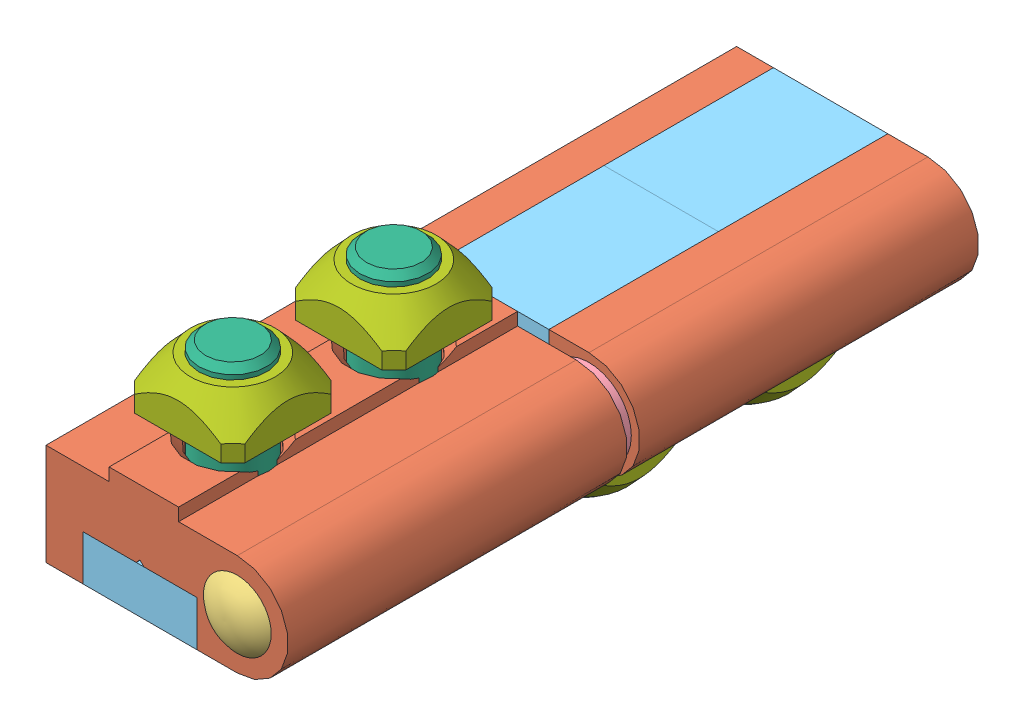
SolidWorks assembly 21.1100 HINGE 19 RIGHT HAND.SLDASM, configuration Default (file format 3800). Lengths in mm.
Overall size (28.58 34.61 84.51).
18 component instances, 7 part files, 38 mates.
Components (placement in the parent):
- 21.1096 HINGE PIN-1: 21.1096 HINGE PIN.SLDPRT [Default] at origin size (6.07 6.07 65)
- 21.1100 HINGE 19 AL BLOCK-1: 21.1100 HINGE 19 AL BLOCK.SLDPRT [Default] at (-11.5 -6 -8.25) x (-1 0 0) z (0 0 -1) size (28.58 13.5 40)
- 21.1100 HINGE 19 AL BLOCK-2: 21.1100 HINGE 19 AL BLOCK.SLDPRT [Default] at (-11.5 6 73.25) x (-1 0 0) z (0 0 1) size (28.58 13.5 40)
- 21.1096 HINGE PIN END CAP-1: 21.1096 HINGE PIN END CAP.SLDPRT [Default] at (0 0 -9.75) x (1 0 0) z (0 1 0) size (8 7 8)
- 21.1096 HINGE PIN END CAP-2: 21.1096 HINGE PIN END CAP.SLDPRT [Default] at (0 0 74.75) x (1 0 0) z (0 -1 0) size (8 7 8)
- 21.1096 HINGE WASHER-1: 21.1096 HINGE WASHER.SLDPRT [Default] at (0 0 31.75) size (10 10 1.5)
- 22.1050 HINGE SCREW CAP-1: 22.1050 HINGE SCREW CAP.SLDPRT [Default] at (-4.7316 6 21.75) x (0 0 1) z (-1 0 0) size (20 5.34 13.5)
- 22.1050 HINGE SCREW CAP-2: 22.1050 HINGE SCREW CAP.SLDPRT [Default] at (-18.2316 6 1.75) x (0 0 -1) z (1 0 0) size (20 5.34 13.5)
- 22.1050 HINGE SCREW CAP-3: 22.1050 HINGE SCREW CAP.SLDPRT [Default] at (-18.2316 -6 43.25) x (0 0 1) z (1 0 0) size (20 5.34 13.5)
- 22.1050 HINGE SCREW CAP-4: 22.1050 HINGE SCREW CAP.SLDPRT [Default] at (-4.7316 -6 63.25) x (0 0 -1) z (-1 0 0) size (20 5.34 13.5)
- 21.1268 M8X18-1: 21.1268 M8X18.SLDPRT [Default] at (-11.0292 -0.6971 62.75) x (0 1 0) z (0 0 1) size (23 13 13)
- 21.1268 M8X18-2: 21.1268 M8X18.SLDPRT [Default] at (-11.0292 -0.6971 43.75) x (0 1 0) z (0 0 1) size (23 13 13)
- 21.1268 M8X18-3: 21.1268 M8X18.SLDPRT [Default] at (-11.0292 0.6971 21.25) x (0 -1 0) z (0 0 1) size (23 13 13)
- 21.1268 M8X18-4: 21.1268 M8X18.SLDPRT [Default] at (-11.0292 0.6971 2.25) x (0 -1 0) z (0 0 1) size (23 13 13)
- 21.1351 M8 SQUARE NUT-1: 21.1351 M8 SQUARE NUT.SLDPRT [Default] at (-11.0292 10.5 62.75) x (1 0 0) z (0 -1 0) size (13 13 5.5)
- 21.1351 M8 SQUARE NUT-2: 21.1351 M8 SQUARE NUT.SLDPRT [Default] at (-11.0292 10.5 43.75) x (1 0 0) z (0 -1 0) size (13 13 5.5)
- 21.1351 M8 SQUARE NUT-3: 21.1351 M8 SQUARE NUT.SLDPRT [Default] at (-11.0292 -10.5 21.25) x (1 0 0) z (0 1 0) size (13 13 5.5)
- 21.1351 M8 SQUARE NUT-4: 21.1351 M8 SQUARE NUT.SLDPRT [Default] at (-11.0292 -10.5 2.25) x (1 0 0) z (0 1 0) size (13 13 5.5)
Mates (geometry in assembly coordinates):
- Coincident1: coincident aligned: axis of 21.1100 HINGE 19 AL BLOCK-1; axis of 21.1096 HINGE PIN-1
- Distance1: distance = 33.25 mm aligned: plane of 21.1096 HINGE PIN-1 through (0 0 65) normal (0 0 1); plane of 21.1100 HINGE 19 AL BLOCK-1 through (-9.7205 -0.7653 31.75) normal (0 0 1)
- Coincident3: coincident aligned: axis of 21.1096 HINGE PIN-1; axis of 21.1096 HINGE WASHER-1
- Coincident4: coincident anti-aligned: plane of 21.1100 HINGE 19 AL BLOCK-1 through (-9.7205 -0.7653 31.75) normal (0 0 1); plane of 21.1096 HINGE WASHER-1 through (0 0 31.75) normal (0 0 -1)
- Coincident5: coincident anti-aligned: axis of 21.1096 HINGE PIN-1; axis of 21.1100 HINGE 19 AL BLOCK-2
- Coincident6: coincident anti-aligned: plane of 21.1100 HINGE 19 AL BLOCK-2 through (-9.7205 0.7653 33.25) normal (0 0 -1); plane of 21.1096 HINGE WASHER-1 through (0 0 33.25) normal (0 0 1)
- Coincident7: coincident anti-aligned: plane of 21.1100 HINGE 19 AL BLOCK-2 through (-9.7205 0.7653 73.25) normal (0 0 1); plane of 21.1096 HINGE PIN END CAP-2 through (3.55 0 73.25) normal (0 0 -1)
- Coincident8: coincident anti-aligned: axis of 21.1100 HINGE 19 AL BLOCK-2; axis of 21.1096 HINGE PIN END CAP-2
- Coincident9: coincident anti-aligned: plane of 21.1096 HINGE PIN END CAP-1 through (3.55 0 -8.25) normal (0 0 1); plane of 21.1100 HINGE 19 AL BLOCK-1 through (-9.7205 -0.7653 -8.25) normal (0 0 -1)
- Coincident10: coincident anti-aligned: axis of 21.1100 HINGE 19 AL BLOCK-1; axis of 21.1096 HINGE PIN END CAP-1
- Coincident12: coincident aligned: plane of 21.1100 HINGE 19 AL BLOCK-2 through (-4.7316 -6 73.25) normal (0 -1 0); plane of 22.1050 HINGE SCREW CAP-4 through (-4.7316 -6 73.25) normal (0 -1 0)
- Coincident13: coincident anti-aligned: plane of 21.1100 HINGE 19 AL BLOCK-2 through (-4.7316 -0.6603 73.25) normal (-1 0 0); plane of 22.1050 HINGE SCREW CAP-4 through (-4.7316 -4.4369 63.25) normal (1 0 0)
- Coincident15: coincident aligned: plane of 21.1100 HINGE 19 AL BLOCK-2 through (-9.7205 0.7653 73.25) normal (0 0 1); plane of 22.1050 HINGE SCREW CAP-4 through (-4.7316 -0.66 73.25) normal (0 0 1)
- Coincident16: coincident anti-aligned: plane of 22.1050 HINGE SCREW CAP-3 through (-18.2316 -6 53.25) normal (0 0 1); plane of 22.1050 HINGE SCREW CAP-4 through (-4.7316 -6 53.25) normal (0 0 -1)
- Coincident17: coincident aligned: plane of 21.1100 HINGE 19 AL BLOCK-2 through (-4.7316 -6 73.25) normal (0 -1 0); plane of 22.1050 HINGE SCREW CAP-3 through (-18.2316 -6 33.25) normal (0 -1 0)
- Coincident18: coincident anti-aligned: plane of 21.1100 HINGE 19 AL BLOCK-2 through (-4.7316 -0.6603 73.25) normal (-1 0 0); plane of 22.1050 HINGE SCREW CAP-3 through (-4.7316 -4.4369 43.25) normal (1 0 0)
- Coincident19: coincident aligned: plane of 22.1050 HINGE SCREW CAP-2 through (-18.2316 6 -8.25) normal (0 0 -1); plane of 21.1100 HINGE 19 AL BLOCK-1 through (-9.7205 -0.7653 -8.25) normal (0 0 -1)
- Coincident20: coincident aligned: plane of 21.1100 HINGE 19 AL BLOCK-1 through (-22.575 6 -8.25) normal (0 1 0); plane of 22.1050 HINGE SCREW CAP-2 through (-18.2316 6 11.75) normal (0 1 0)
- Coincident21: coincident anti-aligned: plane of 21.1100 HINGE 19 AL BLOCK-1 through (-4.7316 0.6603 -8.25) normal (-1 0 0); plane of 22.1050 HINGE SCREW CAP-2 through (-4.7316 4.4369 1.75) normal (1 0 0)
- Coincident22: coincident anti-aligned: plane of 22.1050 HINGE SCREW CAP-1 through (-4.7316 0.66 11.75) normal (0 0 -1); plane of 22.1050 HINGE SCREW CAP-2 through (-18.2316 0.66 11.75) normal (0 0 1)
- Coincident23: coincident aligned: plane of 21.1100 HINGE 19 AL BLOCK-1 through (-22.575 6 -8.25) normal (0 1 0); plane of 22.1050 HINGE SCREW CAP-1 through (-4.7316 6 11.75) normal (0 1 0)
- Coincident24: coincident anti-aligned: plane of 21.1100 HINGE 19 AL BLOCK-1 through (-18.2316 6 -8.25) normal (1 0 0); plane of 22.1050 HINGE SCREW CAP-1 through (-18.2316 4.4369 21.75) normal (-1 0 0)
- Coincident25: coincident anti-aligned: axis of 21.1100 HINGE 19 AL BLOCK-2; axis of 21.1268 M8X18-1
- Coincident26: coincident anti-aligned: axis of 21.1100 HINGE 19 AL BLOCK-2; axis of 21.1268 M8X18-2
- Coincident27: coincident anti-aligned: axis of 21.1100 HINGE 19 AL BLOCK-1; axis of 21.1268 M8X18-3
- Coincident28: coincident anti-aligned: axis of 21.1100 HINGE 19 AL BLOCK-1; axis of 21.1268 M8X18-4
- Coincident29: coincident anti-aligned: plane of 21.1100 HINGE 19 AL BLOCK-2 through (-18.2316 -0.6971 73.25) normal (0 -1 0); plane of 21.1268 M8X18-1 through (-16.2792 -0.6971 62.75) normal (0 1 0)
- Coincident30: coincident anti-aligned: plane of 21.1100 HINGE 19 AL BLOCK-2 through (-18.2316 -0.6971 73.25) normal (0 -1 0); plane of 21.1268 M8X18-2 through (-16.2792 -0.6971 43.75) normal (0 1 0)
- Coincident31: coincident anti-aligned: plane of 21.1100 HINGE 19 AL BLOCK-1 through (-18.2316 0.6971 -8.25) normal (0 1 0); plane of 21.1268 M8X18-3 through (-5.7792 0.6971 21.25) normal (0 -1 0)
- Coincident32: coincident anti-aligned: plane of 21.1100 HINGE 19 AL BLOCK-1 through (-18.2316 0.6971 -8.25) normal (0 1 0); plane of 21.1268 M8X18-4 through (-5.7792 0.6971 2.25) normal (0 -1 0)
- Coincident33: coincident aligned: axis of 21.1351 M8 SQUARE NUT-4; axis of 21.1268 M8X18-4
- Distance2: distance = 4.5 mm anti-aligned: plane of 21.1351 M8 SQUARE NUT-4 through (-11.0292 -10.5 2.25) normal (0 1 0); plane of 21.1100 HINGE 19 AL BLOCK-1 through (0 -6 -8.25) normal (0 -1 0)
- Coincident35: coincident aligned: axis of 21.1351 M8 SQUARE NUT-3; axis of 21.1268 M8X18-3
- Distance3: distance = 4.5 mm anti-aligned: plane of 21.1100 HINGE 19 AL BLOCK-1 through (0 -6 -8.25) normal (0 -1 0); plane of 21.1351 M8 SQUARE NUT-3 through (-11.0292 -10.5 21.25) normal (0 1 0)
- Coincident37: coincident aligned: axis of 21.1351 M8 SQUARE NUT-2; axis of 21.1268 M8X18-2
- Distance4: distance = 4.5 mm anti-aligned: plane of 21.1100 HINGE 19 AL BLOCK-2 through (0 6 73.25) normal (0 1 0); plane of 21.1351 M8 SQUARE NUT-2 through (-11.0292 10.5 43.75) normal (0 -1 0)
- Coincident39: coincident aligned: axis of 21.1268 M8X18-1; axis of ?
- Distance5: distance = 4.5 mm anti-aligned: plane of 21.1351 M8 SQUARE NUT-1 through (-11.0292 10.5 62.75) normal (0 -1 0); plane of 21.1100 HINGE 19 AL BLOCK-2 through (0 6 73.25) normal (0 1 0)
